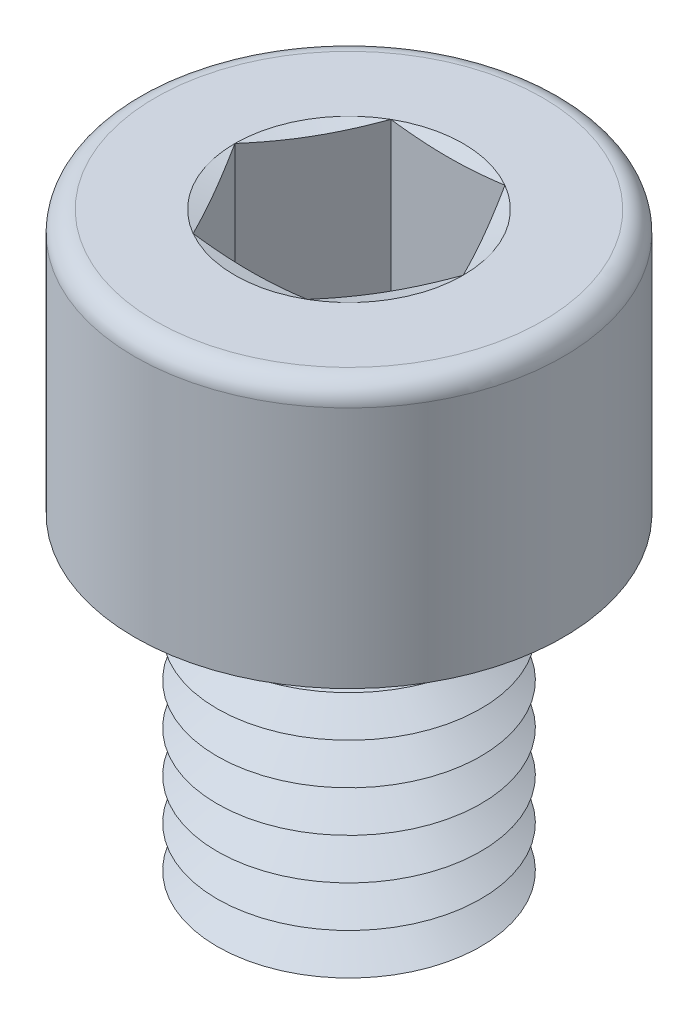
ISO-10303-21;
HEADER;
FILE_DESCRIPTION(('STEP AP214'),'2;1');
FILE_NAME('part.step','',(''),(''),'','','');
FILE_SCHEMA(('AUTOMOTIVE_DESIGN { 1 0 10303 214 1 1 1 1 }'));
ENDSEC;
DATA;
#1=APPLICATION_CONTEXT('core data for automotive mechanical design processes');
#2=APPLICATION_PROTOCOL_DEFINITION('international standard','automotive_design',2000,#1);
#3=PRODUCT_CONTEXT('',#1,'mechanical');
#4=PRODUCT('Part','Part','',(#3));
#5=PRODUCT_RELATED_PRODUCT_CATEGORY('part','',(#4));
#6=PRODUCT_DEFINITION_FORMATION('','',#4);
#7=PRODUCT_DEFINITION_CONTEXT('part definition',#1,'design');
#8=PRODUCT_DEFINITION('design','',#6,#7);
#9=PRODUCT_DEFINITION_SHAPE('','',#8);
#10=(LENGTH_UNIT() NAMED_UNIT(*) SI_UNIT(.MILLI.,.METRE.));
#11=(NAMED_UNIT(*) PLANE_ANGLE_UNIT() SI_UNIT($,.RADIAN.));
#12=(NAMED_UNIT(*) SI_UNIT($,.STERADIAN.) SOLID_ANGLE_UNIT());
#13=UNCERTAINTY_MEASURE_WITH_UNIT(LENGTH_MEASURE(1.E-05),#10,'distance_accuracy_value','');
#14=(GEOMETRIC_REPRESENTATION_CONTEXT(3) GLOBAL_UNCERTAINTY_ASSIGNED_CONTEXT((#13)) GLOBAL_UNIT_ASSIGNED_CONTEXT((#10,
#11,#12)) REPRESENTATION_CONTEXT('',''));
#15=CARTESIAN_POINT('',(0.,0.,0.));
#16=DIRECTION('',(0.,0.,1.));
#17=DIRECTION('',(1.,0.,0.));
#18=AXIS2_PLACEMENT_3D('',#15,#16,#17);
#19=CARTESIAN_POINT('',(0.,5.,0.));
#20=DIRECTION('',(0.,1.,0.));
#21=DIRECTION('',(0.,0.,1.));
#22=AXIS2_PLACEMENT_3D('',#19,#20,#21);
#23=CONICAL_SURFACE('',#22,2.91746824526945,1.0471975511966);
#24=CARTESIAN_POINT('',(0.,5.625,0.));
#25=DIRECTION('',(0.,1.,0.));
#26=DIRECTION('',(0.,0.,1.));
#27=AXIS2_PLACEMENT_3D('',#24,#25,#26);
#28=CIRCLE('',#27,4.);
#29=CARTESIAN_POINT('',(0.,5.625,4.));
#30=VERTEX_POINT('',#29);
#31=EDGE_CURVE('E374',#30,#30,#28,.T.);
#32=ORIENTED_EDGE('',*,*,#31,.F.);
#33=EDGE_LOOP('',(#32));
#34=FACE_BOUND('',#33,.T.);
#35=CARTESIAN_POINT('',(0.,5.,0.));
#36=DIRECTION('',(0.,1.,0.));
#37=DIRECTION('',(0.,0.,1.));
#38=AXIS2_PLACEMENT_3D('',#35,#36,#37);
#39=CIRCLE('',#38,2.91746824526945);
#40=CARTESIAN_POINT('',(0.,5.,2.91746824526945));
#41=VERTEX_POINT('',#40);
#42=EDGE_CURVE('E378',#41,#41,#39,.T.);
#43=ORIENTED_EDGE('',*,*,#42,.T.);
#44=EDGE_LOOP('',(#43));
#45=FACE_BOUND('',#44,.T.);
#46=ADVANCED_FACE('F41',(#34,#45),#23,.T.);
#47=CARTESIAN_POINT('',(0.,4.375,0.));
#48=DIRECTION('',(0.,-1.,0.));
#49=DIRECTION('',(0.,0.,-1.));
#50=AXIS2_PLACEMENT_3D('',#47,#48,#49);
#51=CONICAL_SURFACE('',#50,4.,1.0471975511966);
#52=ORIENTED_EDGE('',*,*,#42,.F.);
#53=EDGE_LOOP('',(#52));
#54=FACE_BOUND('',#53,.T.);
#55=CARTESIAN_POINT('',(0.,4.375,0.));
#56=DIRECTION('',(0.,1.,0.));
#57=DIRECTION('',(0.,0.,1.));
#58=AXIS2_PLACEMENT_3D('',#55,#56,#57);
#59=CIRCLE('',#58,4.);
#60=CARTESIAN_POINT('',(0.,4.375,4.));
#61=VERTEX_POINT('',#60);
#62=EDGE_CURVE('E382',#61,#61,#59,.T.);
#63=ORIENTED_EDGE('',*,*,#62,.T.);
#64=EDGE_LOOP('',(#63));
#65=FACE_BOUND('',#64,.T.);
#66=ADVANCED_FACE('F251',(#54,#65),#51,.T.);
#67=CARTESIAN_POINT('',(0.,0.,0.));
#68=DIRECTION('',(0.,1.,0.));
#69=DIRECTION('',(0.,0.,1.));
#70=AXIS2_PLACEMENT_3D('',#67,#68,#69);
#71=PLANE('',#70);
#72=CARTESIAN_POINT('',(0.,0.,0.));
#73=DIRECTION('',(0.,1.,0.));
#74=DIRECTION('',(0.,0.,1.));
#75=AXIS2_PLACEMENT_3D('',#72,#73,#74);
#76=CIRCLE('',#75,2.91746824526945);
#77=CARTESIAN_POINT('',(0.,0.,2.91746824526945));
#78=VERTEX_POINT('',#77);
#79=EDGE_CURVE('E410',#78,#78,#76,.T.);
#80=ORIENTED_EDGE('',*,*,#79,.F.);
#81=EDGE_LOOP('',(#80));
#82=FACE_BOUND('',#81,.T.);
#83=ADVANCED_FACE('F248',(#82),#71,.F.);
#84=CARTESIAN_POINT('',(0.,0.,0.));
#85=DIRECTION('',(0.,1.,0.));
#86=DIRECTION('',(0.,0.,1.));
#87=AXIS2_PLACEMENT_3D('',#84,#85,#86);
#88=CONICAL_SURFACE('',#87,2.91746824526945,1.0471975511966);
#89=CARTESIAN_POINT('',(0.,0.624999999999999,0.));
#90=DIRECTION('',(0.,1.,0.));
#91=DIRECTION('',(0.,0.,1.));
#92=AXIS2_PLACEMENT_3D('',#89,#90,#91);
#93=CIRCLE('',#92,4.);
#94=CARTESIAN_POINT('',(0.,0.624999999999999,4.));
#95=VERTEX_POINT('',#94);
#96=EDGE_CURVE('E406',#95,#95,#93,.T.);
#97=ORIENTED_EDGE('',*,*,#96,.F.);
#98=EDGE_LOOP('',(#97));
#99=FACE_BOUND('',#98,.T.);
#100=ORIENTED_EDGE('',*,*,#79,.T.);
#101=EDGE_LOOP('',(#100));
#102=FACE_BOUND('',#101,.T.);
#103=ADVANCED_FACE('F250',(#99,#102),#88,.T.);
#104=CARTESIAN_POINT('',(0.,0.624999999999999,0.));
#105=DIRECTION('',(0.,-1.,0.));
#106=DIRECTION('',(0.,0.,-1.));
#107=AXIS2_PLACEMENT_3D('',#104,#105,#106);
#108=CONICAL_SURFACE('',#107,4.,1.0471975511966);
#109=CARTESIAN_POINT('',(0.,1.25,0.));
#110=DIRECTION('',(0.,1.,0.));
#111=DIRECTION('',(0.,0.,1.));
#112=AXIS2_PLACEMENT_3D('',#109,#110,#111);
#113=CIRCLE('',#112,2.91746824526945);
#114=CARTESIAN_POINT('',(0.,1.25,2.91746824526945));
#115=VERTEX_POINT('',#114);
#116=EDGE_CURVE('E402',#115,#115,#113,.T.);
#117=ORIENTED_EDGE('',*,*,#116,.F.);
#118=EDGE_LOOP('',(#117));
#119=FACE_BOUND('',#118,.T.);
#120=ORIENTED_EDGE('',*,*,#96,.T.);
#121=EDGE_LOOP('',(#120));
#122=FACE_BOUND('',#121,.T.);
#123=ADVANCED_FACE('F291',(#119,#122),#108,.T.);
#124=CARTESIAN_POINT('',(0.,1.25,0.));
#125=DIRECTION('',(0.,1.,0.));
#126=DIRECTION('',(0.,0.,1.));
#127=AXIS2_PLACEMENT_3D('',#124,#125,#126);
#128=CONICAL_SURFACE('',#127,2.91746824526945,1.0471975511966);
#129=CARTESIAN_POINT('',(0.,1.875,0.));
#130=DIRECTION('',(0.,1.,0.));
#131=DIRECTION('',(0.,0.,1.));
#132=AXIS2_PLACEMENT_3D('',#129,#130,#131);
#133=CIRCLE('',#132,4.);
#134=CARTESIAN_POINT('',(0.,1.875,4.));
#135=VERTEX_POINT('',#134);
#136=EDGE_CURVE('E398',#135,#135,#133,.T.);
#137=ORIENTED_EDGE('',*,*,#136,.F.);
#138=EDGE_LOOP('',(#137));
#139=FACE_BOUND('',#138,.T.);
#140=ORIENTED_EDGE('',*,*,#116,.T.);
#141=EDGE_LOOP('',(#140));
#142=FACE_BOUND('',#141,.T.);
#143=ADVANCED_FACE('F286',(#139,#142),#128,.T.);
#144=CARTESIAN_POINT('',(0.,1.875,0.));
#145=DIRECTION('',(0.,-1.,0.));
#146=DIRECTION('',(0.,0.,-1.));
#147=AXIS2_PLACEMENT_3D('',#144,#145,#146);
#148=CONICAL_SURFACE('',#147,4.,1.0471975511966);
#149=CARTESIAN_POINT('',(0.,2.5,0.));
#150=DIRECTION('',(0.,1.,0.));
#151=DIRECTION('',(0.,0.,1.));
#152=AXIS2_PLACEMENT_3D('',#149,#150,#151);
#153=CIRCLE('',#152,2.91746824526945);
#154=CARTESIAN_POINT('',(0.,2.5,2.91746824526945));
#155=VERTEX_POINT('',#154);
#156=EDGE_CURVE('E394',#155,#155,#153,.T.);
#157=ORIENTED_EDGE('',*,*,#156,.F.);
#158=EDGE_LOOP('',(#157));
#159=FACE_BOUND('',#158,.T.);
#160=ORIENTED_EDGE('',*,*,#136,.T.);
#161=EDGE_LOOP('',(#160));
#162=FACE_BOUND('',#161,.T.);
#163=ADVANCED_FACE('F283',(#159,#162),#148,.T.);
#164=CARTESIAN_POINT('',(0.,2.5,0.));
#165=DIRECTION('',(0.,1.,0.));
#166=DIRECTION('',(0.,0.,1.));
#167=AXIS2_PLACEMENT_3D('',#164,#165,#166);
#168=CONICAL_SURFACE('',#167,2.91746824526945,1.0471975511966);
#169=CARTESIAN_POINT('',(0.,3.125,0.));
#170=DIRECTION('',(0.,1.,0.));
#171=DIRECTION('',(0.,0.,1.));
#172=AXIS2_PLACEMENT_3D('',#169,#170,#171);
#173=CIRCLE('',#172,4.);
#174=CARTESIAN_POINT('',(0.,3.125,4.));
#175=VERTEX_POINT('',#174);
#176=EDGE_CURVE('E390',#175,#175,#173,.T.);
#177=ORIENTED_EDGE('',*,*,#176,.F.);
#178=EDGE_LOOP('',(#177));
#179=FACE_BOUND('',#178,.T.);
#180=ORIENTED_EDGE('',*,*,#156,.T.);
#181=EDGE_LOOP('',(#180));
#182=FACE_BOUND('',#181,.T.);
#183=ADVANCED_FACE('F277',(#179,#182),#168,.T.);
#184=CARTESIAN_POINT('',(0.,3.125,0.));
#185=DIRECTION('',(0.,-1.,0.));
#186=DIRECTION('',(0.,0.,-1.));
#187=AXIS2_PLACEMENT_3D('',#184,#185,#186);
#188=CONICAL_SURFACE('',#187,4.,1.0471975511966);
#189=CARTESIAN_POINT('',(0.,3.75,0.));
#190=DIRECTION('',(0.,1.,0.));
#191=DIRECTION('',(0.,0.,1.));
#192=AXIS2_PLACEMENT_3D('',#189,#190,#191);
#193=CIRCLE('',#192,2.91746824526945);
#194=CARTESIAN_POINT('',(0.,3.75,2.91746824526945));
#195=VERTEX_POINT('',#194);
#196=EDGE_CURVE('E386',#195,#195,#193,.T.);
#197=ORIENTED_EDGE('',*,*,#196,.F.);
#198=EDGE_LOOP('',(#197));
#199=FACE_BOUND('',#198,.T.);
#200=ORIENTED_EDGE('',*,*,#176,.T.);
#201=EDGE_LOOP('',(#200));
#202=FACE_BOUND('',#201,.T.);
#203=ADVANCED_FACE('F273',(#199,#202),#188,.T.);
#204=CARTESIAN_POINT('',(0.,3.75,0.));
#205=DIRECTION('',(0.,1.,0.));
#206=DIRECTION('',(0.,0.,1.));
#207=AXIS2_PLACEMENT_3D('',#204,#205,#206);
#208=CONICAL_SURFACE('',#207,2.91746824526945,1.0471975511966);
#209=ORIENTED_EDGE('',*,*,#62,.F.);
#210=EDGE_LOOP('',(#209));
#211=FACE_BOUND('',#210,.T.);
#212=ORIENTED_EDGE('',*,*,#196,.T.);
#213=EDGE_LOOP('',(#212));
#214=FACE_BOUND('',#213,.T.);
#215=ADVANCED_FACE('F276',(#211,#214),#208,.T.);
#216=CARTESIAN_POINT('',(0.,6.25,0.));
#217=DIRECTION('',(0.,1.,0.));
#218=DIRECTION('',(0.,0.,1.));
#219=AXIS2_PLACEMENT_3D('',#216,#217,#218);
#220=CONICAL_SURFACE('',#219,2.91746824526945,1.0471975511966);
#221=CARTESIAN_POINT('',(0.,6.875,0.));
#222=DIRECTION('',(0.,1.,0.));
#223=DIRECTION('',(0.,0.,1.));
#224=AXIS2_PLACEMENT_3D('',#221,#222,#223);
#225=CIRCLE('',#224,4.);
#226=CARTESIAN_POINT('',(0.,6.875,4.));
#227=VERTEX_POINT('',#226);
#228=EDGE_CURVE('E366',#227,#227,#225,.T.);
#229=ORIENTED_EDGE('',*,*,#228,.F.);
#230=EDGE_LOOP('',(#229));
#231=FACE_BOUND('',#230,.T.);
#232=CARTESIAN_POINT('',(0.,6.25,0.));
#233=DIRECTION('',(0.,1.,0.));
#234=DIRECTION('',(0.,0.,1.));
#235=AXIS2_PLACEMENT_3D('',#232,#233,#234);
#236=CIRCLE('',#235,2.91746824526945);
#237=CARTESIAN_POINT('',(0.,6.25,2.91746824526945));
#238=VERTEX_POINT('',#237);
#239=EDGE_CURVE('E370',#238,#238,#236,.T.);
#240=ORIENTED_EDGE('',*,*,#239,.T.);
#241=EDGE_LOOP('',(#240));
#242=FACE_BOUND('',#241,.T.);
#243=ADVANCED_FACE('F281',(#231,#242),#220,.T.);
#244=CARTESIAN_POINT('',(0.,5.625,0.));
#245=DIRECTION('',(0.,-1.,0.));
#246=DIRECTION('',(0.,0.,-1.));
#247=AXIS2_PLACEMENT_3D('',#244,#245,#246);
#248=CONICAL_SURFACE('',#247,4.,1.0471975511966);
#249=ORIENTED_EDGE('',*,*,#239,.F.);
#250=EDGE_LOOP('',(#249));
#251=FACE_BOUND('',#250,.T.);
#252=ORIENTED_EDGE('',*,*,#31,.T.);
#253=EDGE_LOOP('',(#252));
#254=FACE_BOUND('',#253,.T.);
#255=ADVANCED_FACE('F644',(#251,#254),#248,.T.);
#256=CARTESIAN_POINT('',(0.,7.5,0.));
#257=DIRECTION('',(0.,1.,0.));
#258=DIRECTION('',(0.,0.,1.));
#259=AXIS2_PLACEMENT_3D('',#256,#257,#258);
#260=CONICAL_SURFACE('',#259,2.91746824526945,1.0471975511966);
#261=CARTESIAN_POINT('',(0.,8.125,0.));
#262=DIRECTION('',(0.,1.,0.));
#263=DIRECTION('',(0.,0.,1.));
#264=AXIS2_PLACEMENT_3D('',#261,#262,#263);
#265=CIRCLE('',#264,4.);
#266=CARTESIAN_POINT('',(0.,8.125,4.));
#267=VERTEX_POINT('',#266);
#268=EDGE_CURVE('E352',#267,#267,#265,.T.);
#269=ORIENTED_EDGE('',*,*,#268,.F.);
#270=EDGE_LOOP('',(#269));
#271=FACE_BOUND('',#270,.T.);
#272=CARTESIAN_POINT('',(0.,7.5,0.));
#273=DIRECTION('',(0.,1.,0.));
#274=DIRECTION('',(0.,0.,1.));
#275=AXIS2_PLACEMENT_3D('',#272,#273,#274);
#276=CIRCLE('',#275,2.91746824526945);
#277=CARTESIAN_POINT('',(0.,7.5,2.91746824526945));
#278=VERTEX_POINT('',#277);
#279=EDGE_CURVE('E362',#278,#278,#276,.T.);
#280=ORIENTED_EDGE('',*,*,#279,.T.);
#281=EDGE_LOOP('',(#280));
#282=FACE_BOUND('',#281,.T.);
#283=ADVANCED_FACE('F653',(#271,#282),#260,.T.);
#284=CARTESIAN_POINT('',(0.,6.875,0.));
#285=DIRECTION('',(0.,-1.,0.));
#286=DIRECTION('',(0.,0.,-1.));
#287=AXIS2_PLACEMENT_3D('',#284,#285,#286);
#288=CONICAL_SURFACE('',#287,4.,1.0471975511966);
#289=ORIENTED_EDGE('',*,*,#279,.F.);
#290=EDGE_LOOP('',(#289));
#291=FACE_BOUND('',#290,.T.);
#292=ORIENTED_EDGE('',*,*,#228,.T.);
#293=EDGE_LOOP('',(#292));
#294=FACE_BOUND('',#293,.T.);
#295=ADVANCED_FACE('F663',(#291,#294),#288,.T.);
#296=CARTESIAN_POINT('',(0.,8.75,0.));
#297=DIRECTION('',(0.,1.,0.));
#298=DIRECTION('',(0.,0.,1.));
#299=AXIS2_PLACEMENT_3D('',#296,#297,#298);
#300=CONICAL_SURFACE('',#299,2.91746824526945,1.0471975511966);
#301=CARTESIAN_POINT('',(0.,9.375,0.));
#302=DIRECTION('',(0.,1.,0.));
#303=DIRECTION('',(0.,0.,1.));
#304=AXIS2_PLACEMENT_3D('',#301,#302,#303);
#305=CIRCLE('',#304,4.);
#306=CARTESIAN_POINT('',(0.,9.375,4.));
#307=VERTEX_POINT('',#306);
#308=EDGE_CURVE('E357',#307,#307,#305,.T.);
#309=ORIENTED_EDGE('',*,*,#308,.F.);
#310=EDGE_LOOP('',(#309));
#311=FACE_BOUND('',#310,.T.);
#312=CARTESIAN_POINT('',(0.,8.75,0.));
#313=DIRECTION('',(0.,1.,0.));
#314=DIRECTION('',(0.,0.,1.));
#315=AXIS2_PLACEMENT_3D('',#312,#313,#314);
#316=CIRCLE('',#315,2.91746824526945);
#317=CARTESIAN_POINT('',(0.,8.75,2.91746824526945));
#318=VERTEX_POINT('',#317);
#319=EDGE_CURVE('E348',#318,#318,#316,.T.);
#320=ORIENTED_EDGE('',*,*,#319,.T.);
#321=EDGE_LOOP('',(#320));
#322=FACE_BOUND('',#321,.T.);
#323=ADVANCED_FACE('F673',(#311,#322),#300,.T.);
#324=CARTESIAN_POINT('',(0.,8.125,0.));
#325=DIRECTION('',(0.,-1.,0.));
#326=DIRECTION('',(0.,0.,-1.));
#327=AXIS2_PLACEMENT_3D('',#324,#325,#326);
#328=CONICAL_SURFACE('',#327,4.,1.0471975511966);
#329=ORIENTED_EDGE('',*,*,#319,.F.);
#330=EDGE_LOOP('',(#329));
#331=FACE_BOUND('',#330,.T.);
#332=ORIENTED_EDGE('',*,*,#268,.T.);
#333=EDGE_LOOP('',(#332));
#334=FACE_BOUND('',#333,.T.);
#335=ADVANCED_FACE('F195',(#331,#334),#328,.T.);
#336=CARTESIAN_POINT('',(0.,18.,0.));
#337=DIRECTION('',(0.,1.,0.));
#338=DIRECTION('',(0.,0.,1.));
#339=AXIS2_PLACEMENT_3D('',#336,#337,#338);
#340=PLANE('',#339);
#341=CARTESIAN_POINT('',(0.,18.,0.));
#342=DIRECTION('',(0.,1.,0.));
#343=DIRECTION('',(0.,0.,1.));
#344=AXIS2_PLACEMENT_3D('',#341,#342,#343);
#345=CIRCLE('',#344,3.46410161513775);
#346=CARTESIAN_POINT('',(1.73205080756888,18.,3.));
#347=VERTEX_POINT('',#346);
#348=CARTESIAN_POINT('',(3.46410161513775,18.,0.));
#349=VERTEX_POINT('',#348);
#350=EDGE_CURVE('E121',#347,#349,#345,.T.);
#351=ORIENTED_EDGE('',*,*,#350,.F.);
#352=CARTESIAN_POINT('',(0.,18.,0.));
#353=DIRECTION('',(0.,1.,0.));
#354=DIRECTION('',(0.,0.,1.));
#355=AXIS2_PLACEMENT_3D('',#352,#353,#354);
#356=CIRCLE('',#355,3.46410161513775);
#357=CARTESIAN_POINT('',(-1.73205080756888,18.,3.));
#358=VERTEX_POINT('',#357);
#359=EDGE_CURVE('E45',#358,#347,#356,.T.);
#360=ORIENTED_EDGE('',*,*,#359,.F.);
#361=CARTESIAN_POINT('',(-3.46410161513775,18.,0.));
#362=VERTEX_POINT('',#361);
#363=EDGE_CURVE('E138',#362,#358,#356,.T.);
#364=ORIENTED_EDGE('',*,*,#363,.F.);
#365=CARTESIAN_POINT('',(-1.73205080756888,18.,-3.));
#366=VERTEX_POINT('',#365);
#367=EDGE_CURVE('E797',#366,#362,#356,.T.);
#368=ORIENTED_EDGE('',*,*,#367,.F.);
#369=CARTESIAN_POINT('',(1.73205080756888,18.,-3.));
#370=VERTEX_POINT('',#369);
#371=EDGE_CURVE('E51',#370,#366,#356,.T.);
#372=ORIENTED_EDGE('',*,*,#371,.F.);
#373=EDGE_CURVE('E11',#349,#370,#356,.T.);
#374=ORIENTED_EDGE('',*,*,#373,.F.);
#375=EDGE_LOOP('',(#351,#360,#364,#368,#372,#374));
#376=FACE_BOUND('',#375,.T.);
#377=CARTESIAN_POINT('',(0.,18.,0.));
#378=DIRECTION('',(0.,1.,0.));
#379=DIRECTION('',(0.,0.,1.));
#380=AXIS2_PLACEMENT_3D('',#377,#378,#379);
#381=CIRCLE('',#380,5.875);
#382=CARTESIAN_POINT('',(0.,18.,5.875));
#383=VERTEX_POINT('',#382);
#384=EDGE_CURVE('E454',#383,#383,#381,.T.);
#385=ORIENTED_EDGE('',*,*,#384,.T.);
#386=EDGE_LOOP('',(#385));
#387=FACE_BOUND('',#386,.T.);
#388=ADVANCED_FACE('F140',(#376,#387),#340,.T.);
#389=CARTESIAN_POINT('',(0.,17.375,0.));
#390=DIRECTION('',(0.,1.,0.));
#391=DIRECTION('',(0.,0.,1.));
#392=AXIS2_PLACEMENT_3D('',#389,#390,#391);
#393=TOROIDAL_SURFACE('',#392,5.875,0.625);
#394=CARTESIAN_POINT('',(0.,17.375,0.));
#395=DIRECTION('',(0.,1.,0.));
#396=DIRECTION('',(0.,0.,1.));
#397=AXIS2_PLACEMENT_3D('',#394,#395,#396);
#398=CIRCLE('',#397,6.5);
#399=CARTESIAN_POINT('',(0.,17.375,6.5));
#400=VERTEX_POINT('',#399);
#401=EDGE_CURVE('E457',#400,#400,#398,.F.);
#402=ORIENTED_EDGE('',*,*,#401,.F.);
#403=EDGE_LOOP('',(#402));
#404=FACE_BOUND('',#403,.T.);
#405=ORIENTED_EDGE('',*,*,#384,.F.);
#406=EDGE_LOOP('',(#405));
#407=FACE_BOUND('',#406,.T.);
#408=ADVANCED_FACE('F43',(#404,#407),#393,.T.);
#409=CARTESIAN_POINT('',(0.,18.,0.));
#410=DIRECTION('',(0.,-1.,0.));
#411=DIRECTION('',(0.,0.,-1.));
#412=AXIS2_PLACEMENT_3D('',#409,#410,#411);
#413=CYLINDRICAL_SURFACE('',#412,6.5);
#414=ORIENTED_EDGE('',*,*,#401,.T.);
#415=EDGE_LOOP('',(#414));
#416=FACE_BOUND('',#415,.T.);
#417=CARTESIAN_POINT('',(0.,10.,0.));
#418=DIRECTION('',(0.,1.,0.));
#419=DIRECTION('',(0.,0.,1.));
#420=AXIS2_PLACEMENT_3D('',#417,#418,#419);
#421=CIRCLE('',#420,6.5);
#422=CARTESIAN_POINT('',(0.,10.,6.5));
#423=VERTEX_POINT('',#422);
#424=EDGE_CURVE('E441',#423,#423,#421,.T.);
#425=ORIENTED_EDGE('',*,*,#424,.T.);
#426=EDGE_LOOP('',(#425));
#427=FACE_BOUND('',#426,.T.);
#428=ADVANCED_FACE('F243',(#416,#427),#413,.T.);
#429=CARTESIAN_POINT('',(0.,10.,0.));
#430=DIRECTION('',(0.,1.,0.));
#431=DIRECTION('',(0.,0.,1.));
#432=AXIS2_PLACEMENT_3D('',#429,#430,#431);
#433=PLANE('',#432);
#434=ORIENTED_EDGE('',*,*,#424,.F.);
#435=EDGE_LOOP('',(#434));
#436=FACE_BOUND('',#435,.T.);
#437=CARTESIAN_POINT('',(0.,10.,0.));
#438=DIRECTION('',(0.,1.,0.));
#439=DIRECTION('',(0.,0.,1.));
#440=AXIS2_PLACEMENT_3D('',#437,#438,#439);
#441=CIRCLE('',#440,4.);
#442=CARTESIAN_POINT('',(0.,10.,4.));
#443=VERTEX_POINT('',#442);
#444=EDGE_CURVE('E450',#443,#443,#441,.T.);
#445=ORIENTED_EDGE('',*,*,#444,.T.);
#446=EDGE_LOOP('',(#445));
#447=FACE_BOUND('',#446,.T.);
#448=ADVANCED_FACE('F239',(#436,#447),#433,.F.);
#449=CARTESIAN_POINT('',(0.,10.,0.));
#450=DIRECTION('',(0.,-1.,0.));
#451=DIRECTION('',(0.,0.,-1.));
#452=AXIS2_PLACEMENT_3D('',#449,#450,#451);
#453=CYLINDRICAL_SURFACE('',#452,4.);
#454=ORIENTED_EDGE('',*,*,#308,.T.);
#455=EDGE_LOOP('',(#454));
#456=FACE_BOUND('',#455,.T.);
#457=ORIENTED_EDGE('',*,*,#444,.F.);
#458=EDGE_LOOP('',(#457));
#459=FACE_BOUND('',#458,.T.);
#460=ADVANCED_FACE('F242',(#456,#459),#453,.T.);
#461=CARTESIAN_POINT('',(0.,18.,0.));
#462=DIRECTION('',(0.,1.,0.));
#463=DIRECTION('',(0.,0.,1.));
#464=AXIS2_PLACEMENT_3D('',#461,#462,#463);
#465=CONICAL_SURFACE('',#464,3.46410161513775,1.30899693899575);
#466=ORIENTED_EDGE('',*,*,#359,.T.);
#467=CARTESIAN_POINT('',(-4.52161137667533,18.5257753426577,3.));
#468=CARTESIAN_POINT('',(-4.38614690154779,18.4955374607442,3.));
#469=CARTESIAN_POINT('',(-4.25059605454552,18.4656802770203,3.));
#470=CARTESIAN_POINT('',(-3.97927914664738,18.4069313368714,3.));
#471=CARTESIAN_POINT('',(-3.84351307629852,18.3780396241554,3.));
#472=CARTESIAN_POINT('',(-3.57159492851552,18.3213991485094,3.));
#473=CARTESIAN_POINT('',(-3.43544259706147,18.2936515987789,3.));
#474=CARTESIAN_POINT('',(-3.16285056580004,18.2396142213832,3.));
#475=CARTESIAN_POINT('',(-3.02641086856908,18.213324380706,3.));
#476=CARTESIAN_POINT('',(-2.61896324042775,18.1375690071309,3.));
#477=CARTESIAN_POINT('',(-2.34745999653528,18.0907136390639,3.));
#478=CARTESIAN_POINT('',(-1.80279754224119,18.0077090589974,3.));
#479=CARTESIAN_POINT('',(-1.52963867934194,17.9715576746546,3.));
#480=CARTESIAN_POINT('',(-1.11712206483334,17.9288850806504,3.));
#481=CARTESIAN_POINT('',(-0.978367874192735,17.9165506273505,3.));
#482=CARTESIAN_POINT('',(-0.700531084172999,17.8964911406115,3.));
#483=CARTESIAN_POINT('',(-0.561448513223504,17.8887657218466,3.));
#484=CARTESIAN_POINT('',(-0.283146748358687,17.8783731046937,3.));
#485=CARTESIAN_POINT('',(-0.143927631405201,17.8757038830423,3.));
#486=CARTESIAN_POINT('',(0.134513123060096,17.8755867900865,3.));
#487=CARTESIAN_POINT('',(0.273734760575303,17.8781389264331,3.));
#488=CARTESIAN_POINT('',(0.552556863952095,17.8883235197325,3.));
#489=CARTESIAN_POINT('',(0.692156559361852,17.8959766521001,3.));
#490=CARTESIAN_POINT('',(0.971024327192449,17.9159351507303,3.));
#491=CARTESIAN_POINT('',(1.11029238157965,17.928240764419,3.));
#492=CARTESIAN_POINT('',(1.3884939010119,17.9568974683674,3.));
#493=CARTESIAN_POINT('',(1.52742710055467,17.9732510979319,3.));
#494=CARTESIAN_POINT('',(1.80484805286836,18.0093419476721,3.));
#495=CARTESIAN_POINT('',(1.94333580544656,18.0290791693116,3.));
#496=CARTESIAN_POINT('',(2.2235029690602,18.0718742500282,3.));
#497=CARTESIAN_POINT('',(2.36517107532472,18.0950054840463,3.));
#498=CARTESIAN_POINT('',(2.64810471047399,18.143617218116,3.));
#499=CARTESIAN_POINT('',(2.78937022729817,18.1690977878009,3.));
#500=CARTESIAN_POINT('',(3.21267286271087,18.2483421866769,3.));
#501=CARTESIAN_POINT('',(3.49418463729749,18.304903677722,3.));
#502=CARTESIAN_POINT('',(4.05626646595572,18.4228276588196,3.));
#503=CARTESIAN_POINT('',(4.33683622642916,18.4841915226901,3.));
#504=CARTESIAN_POINT('',(4.89726247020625,18.6101124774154,3.));
#505=CARTESIAN_POINT('',(5.17711893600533,18.6746696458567,3.));
#506=CARTESIAN_POINT('',(5.73290235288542,18.8051717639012,3.));
#507=CARTESIAN_POINT('',(6.00883557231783,18.871090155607,3.));
#508=CARTESIAN_POINT('',(6.56033924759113,19.0044513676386,3.));
#509=CARTESIAN_POINT('',(6.83590969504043,19.0718942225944,3.));
#510=CARTESIAN_POINT('',(7.38639195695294,19.2077957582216,3.));
#511=CARTESIAN_POINT('',(7.66130415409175,19.2762528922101,3.));
#512=CARTESIAN_POINT('',(8.21090603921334,19.4140133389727,3.));
#513=CARTESIAN_POINT('',(8.48559573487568,19.4833166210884,3.));
#514=CARTESIAN_POINT('',(8.76020986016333,19.5529148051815,3.));
#515=B_SPLINE_CURVE_WITH_KNOTS('',3,(#467,#468,#469,#470,#471,#472,#473,#474,#475,#476,#477,
#478,#479,#480,#481,#482,#483,#484,#485,#486,#487,#488,#489,#490,#491,#492,#493,#494,#495,#496,
#497,#498,#499,#500,#501,#502,#503,#504,#505,#506,#507,#508,#509,#510,#511,#512,#513,#514),
.UNSPECIFIED.,.F.,.F.,(4,2,2,2,2,2,2,2,2,2,2,2,2,2,2,2,2,2,2,2,2,2,2,4),(0.,0.416396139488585,
0.832811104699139,1.24965681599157,1.66649880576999,2.49292514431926,3.31918364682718,
3.73702338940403,4.15482819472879,4.5724657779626,4.99010397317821,5.40944532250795,
5.8288089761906,6.24843636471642,6.66806393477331,7.0986715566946,7.5292919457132,
8.39062817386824,9.25221171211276,10.1138161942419,10.9649037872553,11.8160107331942,
12.6659315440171,13.5158216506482),.UNSPECIFIED.);
#516=EDGE_CURVE('E127',#358,#347,#515,.T.);
#517=ORIENTED_EDGE('',*,*,#516,.F.);
#518=EDGE_LOOP('',(#466,#517));
#519=FACE_BOUND('',#518,.T.);
#520=ADVANCED_FACE('F132',(#519),#465,.F.);
#521=ORIENTED_EDGE('',*,*,#363,.T.);
#522=CARTESIAN_POINT('',(-3.46421708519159,18.0000309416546,-0.000200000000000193));
#523=CARTESIAN_POINT('',(-3.39227980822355,17.9807461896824,0.124399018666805));
#524=CARTESIAN_POINT('',(-3.32021209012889,17.9632387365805,0.249223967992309));
#525=CARTESIAN_POINT('',(-3.17582211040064,17.932479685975,0.49931474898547));
#526=CARTESIAN_POINT('',(-3.10349975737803,17.9192298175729,0.62458073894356));
#527=CARTESIAN_POINT('',(-2.95903905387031,17.8977595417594,0.874794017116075));
#528=CARTESIAN_POINT('',(-2.8869016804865,17.8895135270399,0.99973961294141));
#529=CARTESIAN_POINT('',(-2.74253492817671,17.8784564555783,1.24979016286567));
#530=CARTESIAN_POINT('',(-2.67030556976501,17.8756443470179,1.37489508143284));
#531=CARTESIAN_POINT('',(-2.52584685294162,17.8756443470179,1.62510491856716));
#532=CARTESIAN_POINT('',(-2.45361749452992,17.8784564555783,1.75020983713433));
#533=CARTESIAN_POINT('',(-2.30925074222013,17.8895135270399,2.00026038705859));
#534=CARTESIAN_POINT('',(-2.23711336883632,17.8977595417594,2.12520598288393));
#535=CARTESIAN_POINT('',(-2.0926526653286,17.9192298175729,2.37541926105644));
#536=CARTESIAN_POINT('',(-2.02033031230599,17.932479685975,2.50068525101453));
#537=CARTESIAN_POINT('',(-1.87594033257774,17.9632387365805,2.75077603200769));
#538=CARTESIAN_POINT('',(-1.80387261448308,17.9807461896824,2.8756009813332));
#539=CARTESIAN_POINT('',(-1.73193533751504,18.0000309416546,3.0002));
#540=B_SPLINE_CURVE_WITH_KNOTS('',3,(#522,#523,#524,#525,#526,#527,#528,#529,#530,#531,#532,
#533,#534,#535,#536,#537,#538,#539),.UNSPECIFIED.,.F.,.F.,(4,2,2,2,2,2,2,2,4),(0.,
0.435506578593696,0.871189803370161,1.30462418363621,1.73797465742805,2.17132513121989,
2.60475951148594,3.0404427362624,3.4759493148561),.UNSPECIFIED.);
#541=EDGE_CURVE('E163',#362,#358,#540,.T.);
#542=ORIENTED_EDGE('',*,*,#541,.F.);
#543=EDGE_LOOP('',(#521,#542));
#544=FACE_BOUND('',#543,.T.);
#545=ADVANCED_FACE('F258',(#544),#465,.F.);
#546=ORIENTED_EDGE('',*,*,#367,.T.);
#547=CARTESIAN_POINT('',(-1.73193533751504,18.0000309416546,-3.0002));
#548=CARTESIAN_POINT('',(-1.80387261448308,17.9807461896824,-2.87560098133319));
#549=CARTESIAN_POINT('',(-1.87594033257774,17.9632387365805,-2.75077603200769));
#550=CARTESIAN_POINT('',(-2.02033031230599,17.932479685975,-2.50068525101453));
#551=CARTESIAN_POINT('',(-2.0926526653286,17.9192298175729,-2.37541926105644));
#552=CARTESIAN_POINT('',(-2.23711336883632,17.8977595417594,-2.12520598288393));
#553=CARTESIAN_POINT('',(-2.30925074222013,17.8895135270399,-2.00026038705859));
#554=CARTESIAN_POINT('',(-2.45361749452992,17.8784564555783,-1.75020983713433));
#555=CARTESIAN_POINT('',(-2.52584685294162,17.8756443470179,-1.62510491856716));
#556=CARTESIAN_POINT('',(-2.67030556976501,17.8756443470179,-1.37489508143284));
#557=CARTESIAN_POINT('',(-2.74253492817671,17.8784564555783,-1.24979016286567));
#558=CARTESIAN_POINT('',(-2.8869016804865,17.8895135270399,-0.999739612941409));
#559=CARTESIAN_POINT('',(-2.95903905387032,17.8977595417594,-0.874794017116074));
#560=CARTESIAN_POINT('',(-3.10349975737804,17.9192298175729,-0.62458073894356));
#561=CARTESIAN_POINT('',(-3.17582211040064,17.932479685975,-0.49931474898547));
#562=CARTESIAN_POINT('',(-3.32021209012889,17.9632387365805,-0.249223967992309));
#563=CARTESIAN_POINT('',(-3.39227980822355,17.9807461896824,-0.124399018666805));
#564=CARTESIAN_POINT('',(-3.46421708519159,18.0000309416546,0.00019999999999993));
#565=B_SPLINE_CURVE_WITH_KNOTS('',3,(#547,#548,#549,#550,#551,#552,#553,#554,#555,#556,#557,
#558,#559,#560,#561,#562,#563,#564),.UNSPECIFIED.,.F.,.F.,(4,2,2,2,2,2,2,2,4),(0.,
0.435506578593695,0.87118980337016,1.3046241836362,1.73797465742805,2.17132513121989,
2.60475951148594,3.0404427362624,3.4759493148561),.UNSPECIFIED.);
#566=EDGE_CURVE('E63',#366,#362,#565,.T.);
#567=ORIENTED_EDGE('',*,*,#566,.F.);
#568=EDGE_LOOP('',(#546,#567));
#569=FACE_BOUND('',#568,.T.);
#570=ADVANCED_FACE('F193',(#569),#465,.F.);
#571=ORIENTED_EDGE('',*,*,#371,.T.);
#572=CARTESIAN_POINT('',(-4.52161137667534,18.5257753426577,-3.));
#573=CARTESIAN_POINT('',(-4.3861469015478,18.4955374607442,-3.));
#574=CARTESIAN_POINT('',(-4.25059605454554,18.4656802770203,-3.));
#575=CARTESIAN_POINT('',(-3.97927914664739,18.4069313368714,-3.));
#576=CARTESIAN_POINT('',(-3.84351307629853,18.3780396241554,-3.));
#577=CARTESIAN_POINT('',(-3.57159492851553,18.3213991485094,-3.));
#578=CARTESIAN_POINT('',(-3.43544259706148,18.2936515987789,-3.));
#579=CARTESIAN_POINT('',(-3.16285056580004,18.2396142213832,-3.));
#580=CARTESIAN_POINT('',(-3.02641086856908,18.213324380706,-3.));
#581=CARTESIAN_POINT('',(-2.61896324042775,18.1375690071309,-3.));
#582=CARTESIAN_POINT('',(-2.34745999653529,18.0907136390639,-3.));
#583=CARTESIAN_POINT('',(-1.80279754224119,18.0077090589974,-3.));
#584=CARTESIAN_POINT('',(-1.52963867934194,17.9715576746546,-3.));
#585=CARTESIAN_POINT('',(-1.11712206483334,17.9288850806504,-3.));
#586=CARTESIAN_POINT('',(-0.978367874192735,17.9165506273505,-3.));
#587=CARTESIAN_POINT('',(-0.700531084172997,17.8964911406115,-3.));
#588=CARTESIAN_POINT('',(-0.561448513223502,17.8887657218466,-3.));
#589=CARTESIAN_POINT('',(-0.283146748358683,17.8783731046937,-3.));
#590=CARTESIAN_POINT('',(-0.143927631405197,17.8757038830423,-3.));
#591=CARTESIAN_POINT('',(0.134513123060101,17.8755867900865,-3.));
#592=CARTESIAN_POINT('',(0.273734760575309,17.8781389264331,-3.));
#593=CARTESIAN_POINT('',(0.552556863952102,17.8883235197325,-3.));
#594=CARTESIAN_POINT('',(0.692156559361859,17.8959766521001,-3.));
#595=CARTESIAN_POINT('',(0.971024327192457,17.9159351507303,-3.));
#596=CARTESIAN_POINT('',(1.11029238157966,17.928240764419,-3.));
#597=CARTESIAN_POINT('',(1.38849390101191,17.9568974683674,-3.));
#598=CARTESIAN_POINT('',(1.52742710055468,17.9732510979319,-3.));
#599=CARTESIAN_POINT('',(1.80484805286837,18.0093419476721,-3.));
#600=CARTESIAN_POINT('',(1.94333580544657,18.0290791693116,-3.));
#601=CARTESIAN_POINT('',(2.22350296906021,18.0718742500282,-3.));
#602=CARTESIAN_POINT('',(2.36517107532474,18.0950054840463,-3.));
#603=CARTESIAN_POINT('',(2.648104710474,18.1436172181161,-3.));
#604=CARTESIAN_POINT('',(2.78937022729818,18.1690977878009,-3.));
#605=CARTESIAN_POINT('',(3.21267286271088,18.2483421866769,-3.));
#606=CARTESIAN_POINT('',(3.4941846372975,18.304903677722,-3.));
#607=CARTESIAN_POINT('',(4.05626646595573,18.4228276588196,-3.));
#608=CARTESIAN_POINT('',(4.33683622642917,18.4841915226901,-3.));
#609=CARTESIAN_POINT('',(4.89726247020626,18.6101124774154,-3.));
#610=CARTESIAN_POINT('',(5.17711893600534,18.6746696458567,-3.));
#611=CARTESIAN_POINT('',(5.73290235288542,18.8051717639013,-3.));
#612=CARTESIAN_POINT('',(6.00883557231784,18.871090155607,-3.));
#613=CARTESIAN_POINT('',(6.56033924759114,19.0044513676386,-3.));
#614=CARTESIAN_POINT('',(6.83590969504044,19.0718942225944,-3.));
#615=CARTESIAN_POINT('',(7.38639195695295,19.2077957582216,-3.));
#616=CARTESIAN_POINT('',(7.66130415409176,19.2762528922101,-3.));
#617=CARTESIAN_POINT('',(8.21090603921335,19.4140133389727,-3.));
#618=CARTESIAN_POINT('',(8.48559573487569,19.4833166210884,-3.));
#619=CARTESIAN_POINT('',(8.76020986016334,19.5529148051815,-3.));
#620=B_SPLINE_CURVE_WITH_KNOTS('',3,(#572,#573,#574,#575,#576,#577,#578,#579,#580,#581,#582,
#583,#584,#585,#586,#587,#588,#589,#590,#591,#592,#593,#594,#595,#596,#597,#598,#599,#600,#601,
#602,#603,#604,#605,#606,#607,#608,#609,#610,#611,#612,#613,#614,#615,#616,#617,#618,#619),
.UNSPECIFIED.,.F.,.F.,(4,2,2,2,2,2,2,2,2,2,2,2,2,2,2,2,2,2,2,2,2,2,2,4),(0.,0.416396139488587,
0.832811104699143,1.24965681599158,1.66649880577,2.49292514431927,3.31918364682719,
3.73702338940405,4.15482819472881,4.57246577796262,4.99010397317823,5.40944532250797,
5.82880897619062,6.24843636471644,6.66806393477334,7.09867155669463,7.52929194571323,
8.39062817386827,9.25221171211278,10.113816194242,10.9649037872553,11.8160107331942,
12.6659315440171,13.5158216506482),.UNSPECIFIED.);
#621=EDGE_CURVE('E214',#370,#366,#620,.F.);
#622=ORIENTED_EDGE('',*,*,#621,.F.);
#623=EDGE_LOOP('',(#571,#622));
#624=FACE_BOUND('',#623,.T.);
#625=ADVANCED_FACE('F188',(#624),#465,.F.);
#626=ORIENTED_EDGE('',*,*,#373,.T.);
#627=CARTESIAN_POINT('',(3.46421708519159,18.0000309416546,0.00020000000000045));
#628=CARTESIAN_POINT('',(3.39227980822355,17.9807461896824,-0.124399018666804));
#629=CARTESIAN_POINT('',(3.32021209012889,17.9632387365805,-0.249223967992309));
#630=CARTESIAN_POINT('',(3.17582211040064,17.932479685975,-0.49931474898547));
#631=CARTESIAN_POINT('',(3.10349975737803,17.9192298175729,-0.62458073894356));
#632=CARTESIAN_POINT('',(2.95903905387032,17.8977595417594,-0.874794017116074));
#633=CARTESIAN_POINT('',(2.8869016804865,17.8895135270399,-0.999739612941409));
#634=CARTESIAN_POINT('',(2.74253492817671,17.8784564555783,-1.24979016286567));
#635=CARTESIAN_POINT('',(2.67030556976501,17.8756443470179,-1.37489508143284));
#636=CARTESIAN_POINT('',(2.52584685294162,17.8756443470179,-1.62510491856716));
#637=CARTESIAN_POINT('',(2.45361749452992,17.8784564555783,-1.75020983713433));
#638=CARTESIAN_POINT('',(2.30925074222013,17.8895135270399,-2.00026038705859));
#639=CARTESIAN_POINT('',(2.23711336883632,17.8977595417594,-2.12520598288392));
#640=CARTESIAN_POINT('',(2.0926526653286,17.9192298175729,-2.37541926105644));
#641=CARTESIAN_POINT('',(2.02033031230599,17.932479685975,-2.50068525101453));
#642=CARTESIAN_POINT('',(1.87594033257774,17.9632387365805,-2.75077603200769));
#643=CARTESIAN_POINT('',(1.80387261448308,17.9807461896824,-2.87560098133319));
#644=CARTESIAN_POINT('',(1.73193533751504,18.0000309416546,-3.0002));
#645=B_SPLINE_CURVE_WITH_KNOTS('',3,(#627,#628,#629,#630,#631,#632,#633,#634,#635,#636,#637,
#638,#639,#640,#641,#642,#643,#644),.UNSPECIFIED.,.F.,.F.,(4,2,2,2,2,2,2,2,4),(0.,
0.435506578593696,0.871189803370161,1.30462418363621,1.73797465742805,2.17132513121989,
2.60475951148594,3.0404427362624,3.4759493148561),.UNSPECIFIED.);
#646=EDGE_CURVE('E56',#349,#370,#645,.T.);
#647=ORIENTED_EDGE('',*,*,#646,.F.);
#648=EDGE_LOOP('',(#626,#647));
#649=FACE_BOUND('',#648,.T.);
#650=ADVANCED_FACE('F192',(#649),#465,.F.);
#651=ORIENTED_EDGE('',*,*,#350,.T.);
#652=CARTESIAN_POINT('',(1.73193533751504,18.0000309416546,3.0002));
#653=CARTESIAN_POINT('',(1.80387261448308,17.9807461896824,2.8756009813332));
#654=CARTESIAN_POINT('',(1.87594033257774,17.9632387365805,2.75077603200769));
#655=CARTESIAN_POINT('',(2.02033031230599,17.932479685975,2.50068525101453));
#656=CARTESIAN_POINT('',(2.0926526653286,17.9192298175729,2.37541926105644));
#657=CARTESIAN_POINT('',(2.23711336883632,17.8977595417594,2.12520598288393));
#658=CARTESIAN_POINT('',(2.30925074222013,17.8895135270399,2.00026038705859));
#659=CARTESIAN_POINT('',(2.45361749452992,17.8784564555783,1.75020983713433));
#660=CARTESIAN_POINT('',(2.52584685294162,17.8756443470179,1.62510491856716));
#661=CARTESIAN_POINT('',(2.67030556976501,17.8756443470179,1.37489508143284));
#662=CARTESIAN_POINT('',(2.74253492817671,17.8784564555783,1.24979016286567));
#663=CARTESIAN_POINT('',(2.8869016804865,17.8895135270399,0.99973961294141));
#664=CARTESIAN_POINT('',(2.95903905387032,17.8977595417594,0.874794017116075));
#665=CARTESIAN_POINT('',(3.10349975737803,17.9192298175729,0.624580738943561));
#666=CARTESIAN_POINT('',(3.17582211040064,17.932479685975,0.499314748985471));
#667=CARTESIAN_POINT('',(3.32021209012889,17.9632387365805,0.249223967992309));
#668=CARTESIAN_POINT('',(3.39227980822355,17.9807461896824,0.124399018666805));
#669=CARTESIAN_POINT('',(3.46421708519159,18.0000309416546,-0.00019999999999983));
#670=B_SPLINE_CURVE_WITH_KNOTS('',3,(#652,#653,#654,#655,#656,#657,#658,#659,#660,#661,#662,
#663,#664,#665,#666,#667,#668,#669),.UNSPECIFIED.,.F.,.F.,(4,2,2,2,2,2,2,2,4),(0.,
0.435506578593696,0.87118980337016,1.30462418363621,1.73797465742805,2.17132513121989,
2.60475951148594,3.0404427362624,3.4759493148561),.UNSPECIFIED.);
#671=EDGE_CURVE('E117',#347,#349,#670,.T.);
#672=ORIENTED_EDGE('',*,*,#671,.F.);
#673=EDGE_LOOP('',(#651,#672));
#674=FACE_BOUND('',#673,.T.);
#675=ADVANCED_FACE('F119',(#674),#465,.F.);
#676=CARTESIAN_POINT('',(0.,12.,0.));
#677=DIRECTION('',(0.,1.,0.));
#678=DIRECTION('',(0.,0.,1.));
#679=AXIS2_PLACEMENT_3D('',#676,#677,#678);
#680=CONICAL_SURFACE('',#679,3.,1.0471975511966);
#681=CARTESIAN_POINT('',(0.,10.2679491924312,0.));
#682=VERTEX_POINT('',#681);
#683=VERTEX_LOOP('',#682);
#684=FACE_BOUND('',#683,.T.);
#685=CARTESIAN_POINT('',(0.,12.,0.));
#686=DIRECTION('',(0.,1.,0.));
#687=DIRECTION('',(0.,0.,1.));
#688=AXIS2_PLACEMENT_3D('',#685,#686,#687);
#689=CIRCLE('',#688,3.);
#690=CARTESIAN_POINT('',(0.,12.,3.));
#691=VERTEX_POINT('',#690);
#692=CARTESIAN_POINT('',(2.59807621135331,12.,1.50000000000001));
#693=VERTEX_POINT('',#692);
#694=EDGE_CURVE('E414',#691,#693,#689,.T.);
#695=ORIENTED_EDGE('',*,*,#694,.T.);
#696=CARTESIAN_POINT('',(0.,12.,0.));
#697=DIRECTION('',(0.,1.,0.));
#698=DIRECTION('',(0.,0.,1.));
#699=AXIS2_PLACEMENT_3D('',#696,#697,#698);
#700=CIRCLE('',#699,2.99999999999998);
#701=CARTESIAN_POINT('',(2.59807621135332,12.,-1.49999999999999));
#702=VERTEX_POINT('',#701);
#703=EDGE_CURVE('E139',#693,#702,#700,.T.);
#704=ORIENTED_EDGE('',*,*,#703,.T.);
#705=CARTESIAN_POINT('',(0.,12.,-3.));
#706=VERTEX_POINT('',#705);
#707=EDGE_CURVE('E471',#702,#706,#700,.T.);
#708=ORIENTED_EDGE('',*,*,#707,.T.);
#709=CARTESIAN_POINT('',(-2.59807621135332,12.,-1.49999999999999));
#710=VERTEX_POINT('',#709);
#711=EDGE_CURVE('E469',#706,#710,#700,.T.);
#712=ORIENTED_EDGE('',*,*,#711,.T.);
#713=CARTESIAN_POINT('',(-2.59807621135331,12.,1.50000000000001));
#714=VERTEX_POINT('',#713);
#715=EDGE_CURVE('E462',#710,#714,#700,.T.);
#716=ORIENTED_EDGE('',*,*,#715,.T.);
#717=EDGE_CURVE('E460',#714,#691,#700,.T.);
#718=ORIENTED_EDGE('',*,*,#717,.T.);
#719=EDGE_LOOP('',(#695,#704,#708,#712,#716,#718));
#720=FACE_BOUND('',#719,.T.);
#721=ADVANCED_FACE('F301',(#684,#720),#680,.F.);
#722=CARTESIAN_POINT('',(1.73205080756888,12.,-3.));
#723=DIRECTION('',(0.,1.,0.));
#724=DIRECTION('',(0.,0.,1.));
#725=AXIS2_PLACEMENT_3D('',#722,#723,#724);
#726=PLANE('',#725);
#727=ORIENTED_EDGE('',*,*,#711,.F.);
#728=DIRECTION('',(-1.,0.,0.));
#729=VECTOR('',#728,1.);
#730=CARTESIAN_POINT('',(1.73205080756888,12.,-3.));
#731=LINE('',#730,#729);
#732=CARTESIAN_POINT('',(-1.73205080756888,12.,-3.));
#733=VERTEX_POINT('',#732);
#734=EDGE_CURVE('E421',#706,#733,#731,.T.);
#735=ORIENTED_EDGE('',*,*,#734,.T.);
#736=DIRECTION('',(-0.5,0.,0.866025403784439));
#737=VECTOR('',#736,1.);
#738=CARTESIAN_POINT('',(-1.73205080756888,12.,-3.));
#739=LINE('',#738,#737);
#740=EDGE_CURVE('E338',#733,#710,#739,.T.);
#741=ORIENTED_EDGE('',*,*,#740,.T.);
#742=EDGE_LOOP('',(#727,#735,#741));
#743=FACE_BOUND('',#742,.T.);
#744=ADVANCED_FACE('F304',(#743),#726,.T.);
#745=ORIENTED_EDGE('',*,*,#715,.F.);
#746=CARTESIAN_POINT('',(-3.46410161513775,12.,0.));
#747=VERTEX_POINT('',#746);
#748=EDGE_CURVE('E426',#710,#747,#739,.T.);
#749=ORIENTED_EDGE('',*,*,#748,.T.);
#750=DIRECTION('',(0.5,0.,0.866025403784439));
#751=VECTOR('',#750,1.);
#752=CARTESIAN_POINT('',(-3.46410161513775,12.,0.));
#753=LINE('',#752,#751);
#754=EDGE_CURVE('E328',#747,#714,#753,.T.);
#755=ORIENTED_EDGE('',*,*,#754,.T.);
#756=EDGE_LOOP('',(#745,#749,#755));
#757=FACE_BOUND('',#756,.T.);
#758=ADVANCED_FACE('F309',(#757),#726,.T.);
#759=ORIENTED_EDGE('',*,*,#717,.F.);
#760=CARTESIAN_POINT('',(-1.73205080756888,12.,3.));
#761=VERTEX_POINT('',#760);
#762=EDGE_CURVE('E429',#714,#761,#753,.T.);
#763=ORIENTED_EDGE('',*,*,#762,.T.);
#764=DIRECTION('',(1.,0.,0.));
#765=VECTOR('',#764,1.);
#766=CARTESIAN_POINT('',(-1.73205080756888,12.,3.));
#767=LINE('',#766,#765);
#768=EDGE_CURVE('E433',#761,#691,#767,.T.);
#769=ORIENTED_EDGE('',*,*,#768,.T.);
#770=EDGE_LOOP('',(#759,#763,#769));
#771=FACE_BOUND('',#770,.T.);
#772=ADVANCED_FACE('F306',(#771),#726,.T.);
#773=ORIENTED_EDGE('',*,*,#694,.F.);
#774=CARTESIAN_POINT('',(1.73205080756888,12.,3.));
#775=VERTEX_POINT('',#774);
#776=EDGE_CURVE('E432',#691,#775,#767,.T.);
#777=ORIENTED_EDGE('',*,*,#776,.T.);
#778=DIRECTION('',(0.5,0.,-0.866025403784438));
#779=VECTOR('',#778,1.);
#780=CARTESIAN_POINT('',(1.73205080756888,12.,3.));
#781=LINE('',#780,#779);
#782=EDGE_CURVE('E151',#775,#693,#781,.T.);
#783=ORIENTED_EDGE('',*,*,#782,.T.);
#784=EDGE_LOOP('',(#773,#777,#783));
#785=FACE_BOUND('',#784,.T.);
#786=ADVANCED_FACE('F308',(#785),#726,.T.);
#787=ORIENTED_EDGE('',*,*,#703,.F.);
#788=CARTESIAN_POINT('',(3.46410161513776,12.,0.));
#789=VERTEX_POINT('',#788);
#790=EDGE_CURVE('E437',#693,#789,#781,.T.);
#791=ORIENTED_EDGE('',*,*,#790,.T.);
#792=DIRECTION('',(-0.5,0.,-0.866025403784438));
#793=VECTOR('',#792,1.);
#794=CARTESIAN_POINT('',(3.46410161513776,12.,0.));
#795=LINE('',#794,#793);
#796=EDGE_CURVE('E418',#789,#702,#795,.T.);
#797=ORIENTED_EDGE('',*,*,#796,.T.);
#798=EDGE_LOOP('',(#787,#791,#797));
#799=FACE_BOUND('',#798,.T.);
#800=ADVANCED_FACE('F487',(#799),#726,.T.);
#801=ORIENTED_EDGE('',*,*,#707,.F.);
#802=CARTESIAN_POINT('',(1.73205080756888,12.,-3.));
#803=VERTEX_POINT('',#802);
#804=EDGE_CURVE('E417',#702,#803,#795,.T.);
#805=ORIENTED_EDGE('',*,*,#804,.T.);
#806=EDGE_CURVE('E422',#803,#706,#731,.T.);
#807=ORIENTED_EDGE('',*,*,#806,.T.);
#808=EDGE_LOOP('',(#801,#805,#807));
#809=FACE_BOUND('',#808,.T.);
#810=ADVANCED_FACE('F235',(#809),#726,.T.);
#811=CARTESIAN_POINT('',(3.46410161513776,12.,0.));
#812=DIRECTION('',(0.866025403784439,0.,-0.5));
#813=DIRECTION('',(-0.5,0.,-0.866025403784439));
#814=AXIS2_PLACEMENT_3D('',#811,#812,#813);
#815=PLANE('',#814);
#816=DIRECTION('',(0.,1.,0.));
#817=VECTOR('',#816,1.);
#818=CARTESIAN_POINT('',(3.46410161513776,12.,0.));
#819=LINE('',#818,#817);
#820=EDGE_CURVE('E155',#789,#349,#819,.T.);
#821=ORIENTED_EDGE('',*,*,#820,.T.);
#822=ORIENTED_EDGE('',*,*,#646,.T.);
#823=DIRECTION('',(0.,1.,0.));
#824=VECTOR('',#823,1.);
#825=CARTESIAN_POINT('',(1.73205080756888,12.,-3.));
#826=LINE('',#825,#824);
#827=EDGE_CURVE('E341',#803,#370,#826,.T.);
#828=ORIENTED_EDGE('',*,*,#827,.F.);
#829=ORIENTED_EDGE('',*,*,#804,.F.);
#830=ORIENTED_EDGE('',*,*,#796,.F.);
#831=EDGE_LOOP('',(#821,#822,#828,#829,#830));
#832=FACE_BOUND('',#831,.T.);
#833=ADVANCED_FACE('F231',(#832),#815,.F.);
#834=CARTESIAN_POINT('',(1.73205080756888,12.,3.));
#835=DIRECTION('',(0.866025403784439,0.,0.5));
#836=DIRECTION('',(0.5,0.,-0.866025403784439));
#837=AXIS2_PLACEMENT_3D('',#834,#835,#836);
#838=PLANE('',#837);
#839=DIRECTION('',(0.,1.,0.));
#840=VECTOR('',#839,1.);
#841=CARTESIAN_POINT('',(1.73205080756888,12.,3.));
#842=LINE('',#841,#840);
#843=EDGE_CURVE('E147',#775,#347,#842,.T.);
#844=ORIENTED_EDGE('',*,*,#843,.T.);
#845=ORIENTED_EDGE('',*,*,#671,.T.);
#846=ORIENTED_EDGE('',*,*,#820,.F.);
#847=ORIENTED_EDGE('',*,*,#790,.F.);
#848=ORIENTED_EDGE('',*,*,#782,.F.);
#849=EDGE_LOOP('',(#844,#845,#846,#847,#848));
#850=FACE_BOUND('',#849,.T.);
#851=ADVANCED_FACE('F148',(#850),#838,.F.);
#852=CARTESIAN_POINT('',(-1.73205080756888,12.,3.));
#853=DIRECTION('',(0.,0.,1.));
#854=DIRECTION('',(1.,0.,0.));
#855=AXIS2_PLACEMENT_3D('',#852,#853,#854);
#856=PLANE('',#855);
#857=DIRECTION('',(0.,1.,0.));
#858=VECTOR('',#857,1.);
#859=CARTESIAN_POINT('',(-1.73205080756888,12.,3.));
#860=LINE('',#859,#858);
#861=EDGE_CURVE('E156',#761,#358,#860,.T.);
#862=ORIENTED_EDGE('',*,*,#861,.T.);
#863=ORIENTED_EDGE('',*,*,#516,.T.);
#864=ORIENTED_EDGE('',*,*,#843,.F.);
#865=ORIENTED_EDGE('',*,*,#776,.F.);
#866=ORIENTED_EDGE('',*,*,#768,.F.);
#867=EDGE_LOOP('',(#862,#863,#864,#865,#866));
#868=FACE_BOUND('',#867,.T.);
#869=ADVANCED_FACE('F158',(#868),#856,.F.);
#870=CARTESIAN_POINT('',(-3.46410161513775,12.,0.));
#871=DIRECTION('',(-0.866025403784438,0.,0.5));
#872=DIRECTION('',(0.5,0.,0.866025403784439));
#873=AXIS2_PLACEMENT_3D('',#870,#871,#872);
#874=PLANE('',#873);
#875=DIRECTION('',(0.,1.,0.));
#876=VECTOR('',#875,1.);
#877=CARTESIAN_POINT('',(-3.46410161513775,12.,0.));
#878=LINE('',#877,#876);
#879=EDGE_CURVE('E325',#747,#362,#878,.T.);
#880=ORIENTED_EDGE('',*,*,#879,.T.);
#881=ORIENTED_EDGE('',*,*,#541,.T.);
#882=ORIENTED_EDGE('',*,*,#861,.F.);
#883=ORIENTED_EDGE('',*,*,#762,.F.);
#884=ORIENTED_EDGE('',*,*,#754,.F.);
#885=EDGE_LOOP('',(#880,#881,#882,#883,#884));
#886=FACE_BOUND('',#885,.T.);
#887=ADVANCED_FACE('F225',(#886),#874,.F.);
#888=CARTESIAN_POINT('',(-1.73205080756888,12.,-3.));
#889=DIRECTION('',(-0.866025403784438,0.,-0.5));
#890=DIRECTION('',(-0.5,0.,0.866025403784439));
#891=AXIS2_PLACEMENT_3D('',#888,#889,#890);
#892=PLANE('',#891);
#893=DIRECTION('',(0.,1.,0.));
#894=VECTOR('',#893,1.);
#895=CARTESIAN_POINT('',(-1.73205080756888,12.,-3.));
#896=LINE('',#895,#894);
#897=EDGE_CURVE('E331',#733,#366,#896,.T.);
#898=ORIENTED_EDGE('',*,*,#897,.T.);
#899=ORIENTED_EDGE('',*,*,#566,.T.);
#900=ORIENTED_EDGE('',*,*,#879,.F.);
#901=ORIENTED_EDGE('',*,*,#748,.F.);
#902=ORIENTED_EDGE('',*,*,#740,.F.);
#903=EDGE_LOOP('',(#898,#899,#900,#901,#902));
#904=FACE_BOUND('',#903,.T.);
#905=ADVANCED_FACE('F221',(#904),#892,.F.);
#906=CARTESIAN_POINT('',(1.73205080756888,12.,-3.));
#907=DIRECTION('',(0.,0.,-1.));
#908=DIRECTION('',(-1.,0.,0.));
#909=AXIS2_PLACEMENT_3D('',#906,#907,#908);
#910=PLANE('',#909);
#911=ORIENTED_EDGE('',*,*,#827,.T.);
#912=ORIENTED_EDGE('',*,*,#621,.T.);
#913=ORIENTED_EDGE('',*,*,#897,.F.);
#914=ORIENTED_EDGE('',*,*,#734,.F.);
#915=ORIENTED_EDGE('',*,*,#806,.F.);
#916=EDGE_LOOP('',(#911,#912,#913,#914,#915));
#917=FACE_BOUND('',#916,.T.);
#918=ADVANCED_FACE('F224',(#917),#910,.F.);
#919=CLOSED_SHELL('',(#46,#66,#83,#103,#123,#143,#163,#183,#203,#215,#243,#255,#283,#295,#323,
#335,#388,#408,#428,#448,#460,#520,#545,#570,#625,#650,#675,#721,#744,#758,#772,#786,#800,#810,
#833,#851,#869,#887,#905,#918));
#920=MANIFOLD_SOLID_BREP('B2',#919);
#921=ADVANCED_BREP_SHAPE_REPRESENTATION('',(#18,#920),#14);
#922=SHAPE_DEFINITION_REPRESENTATION(#9,#921);
ENDSEC;
END-ISO-10303-21;
